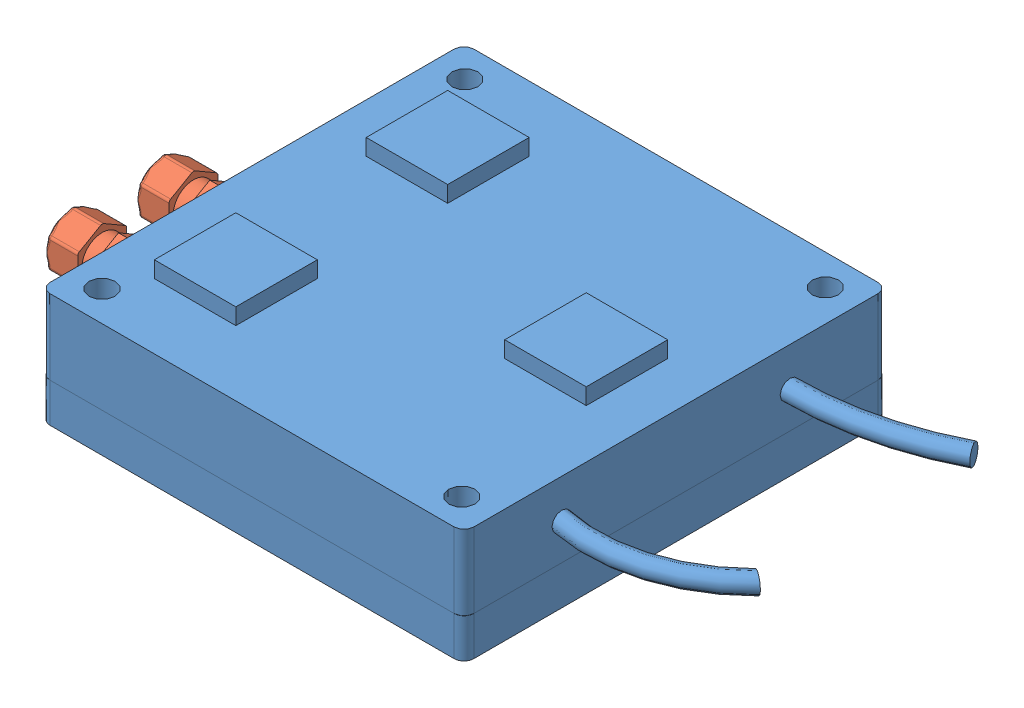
SolidWorks assembly Boitier de Communication.SLDASM, configuration Défaut (file format 5000). Lengths in mm.
Overall size (201.66 40 130).
5 component instances, 3 part files, 10 mates.
Components (placement in the parent):
- Boitier de Communication-1: Boitier de Communication.SLDPRT [Défaut] at (-75.6474 -46.2784 -66.27) size (178.74 40 130)
- PG7-1: PG7.SLDPRT [Défaut] at (-76.6474 -35.2784 5.73) x (0 1 0) z (0 0 1) size (17.32 29.92 17)
- PG7-2: PG7.SLDPRT [Défaut] at (-76.6474 -35.2784 33.73) x (0 1 0) z (0 0 1) size (17.32 29.92 17)
- Ecrou PG7-1: Ecrou PG7.SLDPRT [Défaut] at (-71.6474 -35.2784 33.73) x (0 0 -1) z (0 -1 0) size (21.94 5 19)
- Ecrou PG7-2: Ecrou PG7.SLDPRT [Défaut] at (-71.6474 -35.2784 5.73) x (0 -0.866025 -0.5) z (0 -0.5 0.866025) size (21.94 5 19)
Mates (geometry in assembly coordinates):
- Coïncidente1: coincident anti-aligned: plane of Boitier de Communication-1 through (-71.6474 -28.2784 44.23) normal (1 0 0); plane of Ecrou PG7-2 through (-71.6474 -44.7784 11.2148) normal (-1 0 0)
- Coïncidente2: coincident anti-aligned: plane of Boitier de Communication-1 through (-71.6474 -28.2784 44.23) normal (1 0 0); plane of Ecrou PG7-1 through (-71.6474 -44.7784 28.2452) normal (-1 0 0)
- Coaxiale1: concentric anti-aligned: circle of Boitier de Communication-1; circle of Ecrou PG7-2
- Coaxiale2: concentric anti-aligned: circle of Boitier de Communication-1; circle of Ecrou PG7-1
- Coïncidente3: coincident aligned: plane of Ecrou PG7-1 through (-66.6474 -44.7784 39.2148) normal (0 -1 0); plane of Ecrou PG7-2 through (-66.6474 -44.7784 11.2148) normal (0 -1 0)
- Parallèle1: parallel aligned: plane of Boitier de Communication-1 through (-75.6474 -46.2784 63.73) normal (0 -1 0); plane of Ecrou PG7-1 through (-66.6474 -44.7784 39.2148) normal (0 -1 0)
- Coaxiale3: concentric anti-aligned: cylinder of PG7-1 through (-96.6474 -35.2784 5.73) axis (1 0 0) radius 6.25; cylinder of Ecrou PG7-2 through (-66.6474 -35.2784 5.73) axis (-1 0 0) radius 5.65
- Coaxiale4: concentric anti-aligned: cylinder of PG7-2 through (-96.6474 -35.2784 33.73) axis (1 0 0) radius 6.25; cylinder of Ecrou PG7-1 through (-66.6474 -35.2784 33.73) axis (-1 0 0) radius 5.65
- Coïncidente4: coincident anti-aligned: plane of Boitier de Communication-1 through (-75.6474 -23.2784 -66.27) normal (-1 0 0); plane of PG7-1 through (-75.6474 -35.2784 5.73) normal (1 0 0)
- Coïncidente5: coincident anti-aligned: plane of Boitier de Communication-1 through (-75.6474 -23.2784 -66.27) normal (-1 0 0); plane of PG7-2 through (-75.6474 -35.2784 33.73) normal (1 0 0)
